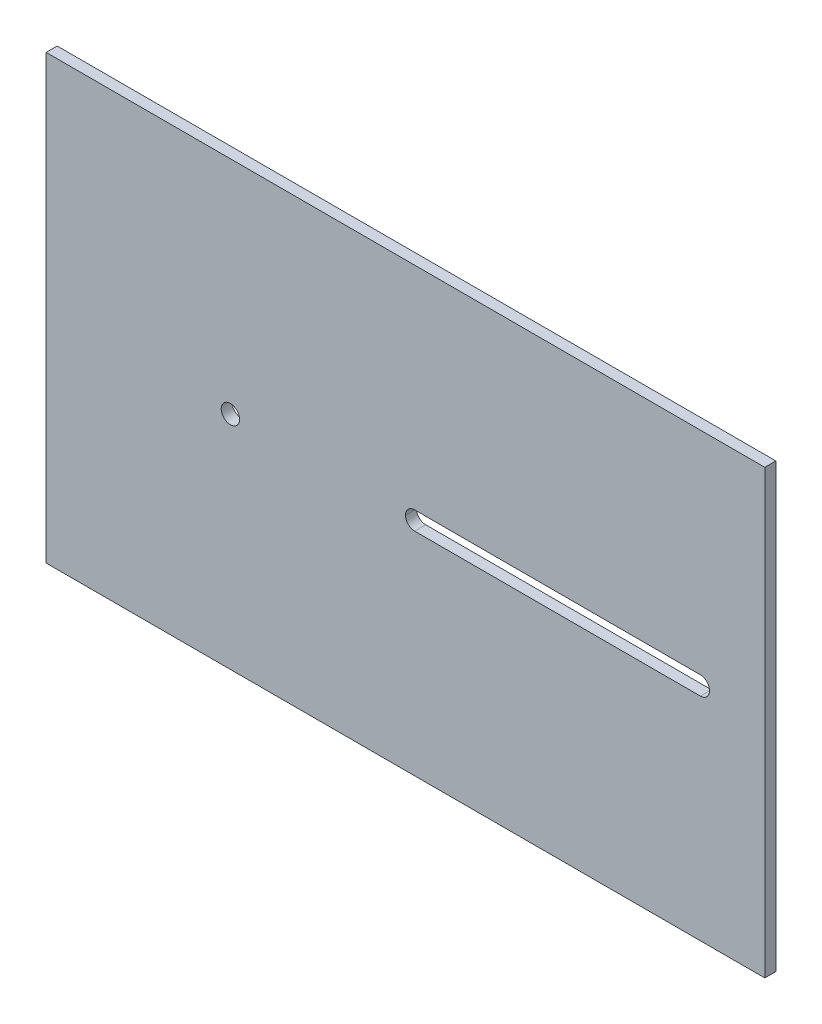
ISO-10303-21;
HEADER;
FILE_DESCRIPTION(('STEP AP214'),'2;1');
FILE_NAME('part.step','',(''),(''),'','','');
FILE_SCHEMA(('AUTOMOTIVE_DESIGN { 1 0 10303 214 1 1 1 1 }'));
ENDSEC;
DATA;
#1=APPLICATION_CONTEXT('core data for automotive mechanical design processes');
#2=APPLICATION_PROTOCOL_DEFINITION('international standard','automotive_design',2000,#1);
#3=PRODUCT_CONTEXT('',#1,'mechanical');
#4=PRODUCT('Part','Part','',(#3));
#5=PRODUCT_RELATED_PRODUCT_CATEGORY('part','',(#4));
#6=PRODUCT_DEFINITION_FORMATION('','',#4);
#7=PRODUCT_DEFINITION_CONTEXT('part definition',#1,'design');
#8=PRODUCT_DEFINITION('design','',#6,#7);
#9=PRODUCT_DEFINITION_SHAPE('','',#8);
#10=(LENGTH_UNIT() NAMED_UNIT(*) SI_UNIT(.MILLI.,.METRE.));
#11=(NAMED_UNIT(*) PLANE_ANGLE_UNIT() SI_UNIT($,.RADIAN.));
#12=(NAMED_UNIT(*) SI_UNIT($,.STERADIAN.) SOLID_ANGLE_UNIT());
#13=UNCERTAINTY_MEASURE_WITH_UNIT(LENGTH_MEASURE(1.E-05),#10,'distance_accuracy_value','');
#14=(GEOMETRIC_REPRESENTATION_CONTEXT(3) GLOBAL_UNCERTAINTY_ASSIGNED_CONTEXT((#13)) GLOBAL_UNIT_ASSIGNED_CONTEXT((#10,
#11,#12)) REPRESENTATION_CONTEXT('',''));
#15=CARTESIAN_POINT('',(0.,0.,0.));
#16=DIRECTION('',(0.,0.,1.));
#17=DIRECTION('',(1.,0.,0.));
#18=AXIS2_PLACEMENT_3D('',#15,#16,#17);
#19=CARTESIAN_POINT('',(-75.7745027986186,50.7636179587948,3.));
#20=DIRECTION('',(1.,0.,0.));
#21=DIRECTION('',(0.,1.,0.));
#22=AXIS2_PLACEMENT_3D('',#19,#20,#21);
#23=PLANE('',#22);
#24=DIRECTION('',(0.,-1.,0.));
#25=VECTOR('',#24,1.);
#26=CARTESIAN_POINT('',(-75.7745027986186,50.7636179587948,0.));
#27=LINE('',#26,#25);
#28=CARTESIAN_POINT('',(-75.7745027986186,50.7636179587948,0.));
#29=VERTEX_POINT('',#28);
#30=CARTESIAN_POINT('',(-75.7745027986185,-69.2363820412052,0.));
#31=VERTEX_POINT('',#30);
#32=EDGE_CURVE('E197',#29,#31,#27,.T.);
#33=ORIENTED_EDGE('',*,*,#32,.T.);
#34=DIRECTION('',(0.,0.,-1.));
#35=VECTOR('',#34,1.);
#36=CARTESIAN_POINT('',(-75.7745027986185,-69.2363820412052,3.));
#37=LINE('',#36,#35);
#38=CARTESIAN_POINT('',(-75.7745027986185,-69.2363820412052,3.));
#39=VERTEX_POINT('',#38);
#40=EDGE_CURVE('E11',#39,#31,#37,.T.);
#41=ORIENTED_EDGE('',*,*,#40,.F.);
#42=DIRECTION('',(0.,-1.,0.));
#43=VECTOR('',#42,1.);
#44=CARTESIAN_POINT('',(-75.7745027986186,50.7636179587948,3.));
#45=LINE('',#44,#43);
#46=CARTESIAN_POINT('',(-75.7745027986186,50.7636179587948,3.));
#47=VERTEX_POINT('',#46);
#48=EDGE_CURVE('E206',#47,#39,#45,.T.);
#49=ORIENTED_EDGE('',*,*,#48,.F.);
#50=DIRECTION('',(0.,0.,-1.));
#51=VECTOR('',#50,1.);
#52=CARTESIAN_POINT('',(-75.7745027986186,50.7636179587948,3.));
#53=LINE('',#52,#51);
#54=EDGE_CURVE('E216',#47,#29,#53,.T.);
#55=ORIENTED_EDGE('',*,*,#54,.T.);
#56=EDGE_LOOP('',(#33,#41,#49,#55));
#57=FACE_BOUND('',#56,.T.);
#58=ADVANCED_FACE('F34',(#57),#23,.F.);
#59=CARTESIAN_POINT('',(-75.7745027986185,-69.2363820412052,3.));
#60=DIRECTION('',(0.,1.,0.));
#61=DIRECTION('',(0.,0.,1.));
#62=AXIS2_PLACEMENT_3D('',#59,#60,#61);
#63=PLANE('',#62);
#64=DIRECTION('',(1.,0.,0.));
#65=VECTOR('',#64,1.);
#66=CARTESIAN_POINT('',(-75.7745027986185,-69.2363820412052,0.));
#67=LINE('',#66,#65);
#68=CARTESIAN_POINT('',(119.225497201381,-69.2363820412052,0.));
#69=VERTEX_POINT('',#68);
#70=EDGE_CURVE('E200',#31,#69,#67,.T.);
#71=ORIENTED_EDGE('',*,*,#70,.T.);
#72=DIRECTION('',(0.,0.,-1.));
#73=VECTOR('',#72,1.);
#74=CARTESIAN_POINT('',(119.225497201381,-69.2363820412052,3.));
#75=LINE('',#74,#73);
#76=CARTESIAN_POINT('',(119.225497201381,-69.2363820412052,3.));
#77=VERTEX_POINT('',#76);
#78=EDGE_CURVE('E41',#77,#69,#75,.T.);
#79=ORIENTED_EDGE('',*,*,#78,.F.);
#80=DIRECTION('',(1.,0.,0.));
#81=VECTOR('',#80,1.);
#82=CARTESIAN_POINT('',(-75.7745027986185,-69.2363820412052,3.));
#83=LINE('',#82,#81);
#84=EDGE_CURVE('E209',#39,#77,#83,.T.);
#85=ORIENTED_EDGE('',*,*,#84,.F.);
#86=ORIENTED_EDGE('',*,*,#40,.T.);
#87=EDGE_LOOP('',(#71,#79,#85,#86));
#88=FACE_BOUND('',#87,.T.);
#89=ADVANCED_FACE('F241',(#88),#63,.F.);
#90=CARTESIAN_POINT('',(119.225497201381,50.7636179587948,3.));
#91=DIRECTION('',(-1.,0.,0.));
#92=DIRECTION('',(0.,-1.,0.));
#93=AXIS2_PLACEMENT_3D('',#90,#91,#92);
#94=PLANE('',#93);
#95=DIRECTION('',(0.,1.,0.));
#96=VECTOR('',#95,1.);
#97=CARTESIAN_POINT('',(119.225497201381,50.7636179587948,0.));
#98=LINE('',#97,#96);
#99=CARTESIAN_POINT('',(119.225497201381,50.7636179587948,0.));
#100=VERTEX_POINT('',#99);
#101=EDGE_CURVE('E202',#69,#100,#98,.T.);
#102=ORIENTED_EDGE('',*,*,#101,.T.);
#103=DIRECTION('',(0.,0.,-1.));
#104=VECTOR('',#103,1.);
#105=CARTESIAN_POINT('',(119.225497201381,50.7636179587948,3.));
#106=LINE('',#105,#104);
#107=CARTESIAN_POINT('',(119.225497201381,50.7636179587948,3.));
#108=VERTEX_POINT('',#107);
#109=EDGE_CURVE('E219',#108,#100,#106,.T.);
#110=ORIENTED_EDGE('',*,*,#109,.F.);
#111=DIRECTION('',(0.,1.,0.));
#112=VECTOR('',#111,1.);
#113=CARTESIAN_POINT('',(119.225497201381,50.7636179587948,3.));
#114=LINE('',#113,#112);
#115=EDGE_CURVE('E211',#77,#108,#114,.T.);
#116=ORIENTED_EDGE('',*,*,#115,.F.);
#117=ORIENTED_EDGE('',*,*,#78,.T.);
#118=EDGE_LOOP('',(#102,#110,#116,#117));
#119=FACE_BOUND('',#118,.T.);
#120=ADVANCED_FACE('F226',(#119),#94,.F.);
#121=CARTESIAN_POINT('',(-75.7745027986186,50.7636179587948,3.));
#122=DIRECTION('',(0.,-1.,0.));
#123=DIRECTION('',(0.,0.,-1.));
#124=AXIS2_PLACEMENT_3D('',#121,#122,#123);
#125=PLANE('',#124);
#126=DIRECTION('',(-1.,0.,0.));
#127=VECTOR('',#126,1.);
#128=CARTESIAN_POINT('',(-75.7745027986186,50.7636179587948,0.));
#129=LINE('',#128,#127);
#130=EDGE_CURVE('E204',#100,#29,#129,.T.);
#131=ORIENTED_EDGE('',*,*,#130,.T.);
#132=ORIENTED_EDGE('',*,*,#54,.F.);
#133=DIRECTION('',(-1.,0.,0.));
#134=VECTOR('',#133,1.);
#135=CARTESIAN_POINT('',(-75.7745027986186,50.7636179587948,3.));
#136=LINE('',#135,#134);
#137=EDGE_CURVE('E213',#108,#47,#136,.T.);
#138=ORIENTED_EDGE('',*,*,#137,.F.);
#139=ORIENTED_EDGE('',*,*,#109,.T.);
#140=EDGE_LOOP('',(#131,#132,#138,#139));
#141=FACE_BOUND('',#140,.T.);
#142=ADVANCED_FACE('F235',(#141),#125,.F.);
#143=CARTESIAN_POINT('',(-75.7745027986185,-69.2363820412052,3.));
#144=DIRECTION('',(0.,0.,1.));
#145=DIRECTION('',(1.,0.,0.));
#146=AXIS2_PLACEMENT_3D('',#143,#144,#145);
#147=PLANE('',#146);
#148=CARTESIAN_POINT('',(24.2154972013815,-9.2263820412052,3.));
#149=DIRECTION('',(0.,0.,1.));
#150=DIRECTION('',(1.,0.,0.));
#151=AXIS2_PLACEMENT_3D('',#148,#149,#150);
#152=CIRCLE('',#151,2.49);
#153=CARTESIAN_POINT('',(24.2154972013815,-6.7363820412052,3.));
#154=VERTEX_POINT('',#153);
#155=CARTESIAN_POINT('',(21.7254972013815,-9.2263820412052,3.));
#156=VERTEX_POINT('',#155);
#157=EDGE_CURVE('E48',#154,#156,#152,.T.);
#158=ORIENTED_EDGE('',*,*,#157,.F.);
#159=DIRECTION('',(-1.,0.,0.));
#160=VECTOR('',#159,1.);
#161=CARTESIAN_POINT('',(24.2154972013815,-6.7363820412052,3.));
#162=LINE('',#161,#160);
#163=CARTESIAN_POINT('',(101.735497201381,-6.7363820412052,3.));
#164=VERTEX_POINT('',#163);
#165=EDGE_CURVE('E155',#164,#154,#162,.T.);
#166=ORIENTED_EDGE('',*,*,#165,.F.);
#167=CARTESIAN_POINT('',(101.735497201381,-9.2263820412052,3.));
#168=DIRECTION('',(0.,0.,1.));
#169=DIRECTION('',(-1.,0.,0.));
#170=AXIS2_PLACEMENT_3D('',#167,#168,#169);
#171=CIRCLE('',#170,2.49);
#172=CARTESIAN_POINT('',(104.225497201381,-9.22638204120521,3.));
#173=VERTEX_POINT('',#172);
#174=EDGE_CURVE('E152',#173,#164,#171,.T.);
#175=ORIENTED_EDGE('',*,*,#174,.F.);
#176=DIRECTION('',(0.,1.,0.));
#177=VECTOR('',#176,1.);
#178=CARTESIAN_POINT('',(104.225497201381,-9.22638204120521,3.));
#179=LINE('',#178,#177);
#180=CARTESIAN_POINT('',(104.225497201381,-9.24638204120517,3.));
#181=VERTEX_POINT('',#180);
#182=EDGE_CURVE('E149',#181,#173,#179,.T.);
#183=ORIENTED_EDGE('',*,*,#182,.F.);
#184=CARTESIAN_POINT('',(101.735497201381,-9.2463820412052,3.));
#185=DIRECTION('',(0.,0.,1.));
#186=DIRECTION('',(1.,0.,0.));
#187=AXIS2_PLACEMENT_3D('',#184,#185,#186);
#188=CIRCLE('',#187,2.49);
#189=CARTESIAN_POINT('',(101.735497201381,-11.7363820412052,3.));
#190=VERTEX_POINT('',#189);
#191=EDGE_CURVE('E143',#190,#181,#188,.T.);
#192=ORIENTED_EDGE('',*,*,#191,.F.);
#193=DIRECTION('',(1.,0.,0.));
#194=VECTOR('',#193,1.);
#195=CARTESIAN_POINT('',(24.2154972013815,-11.7363820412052,3.));
#196=LINE('',#195,#194);
#197=CARTESIAN_POINT('',(24.2154972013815,-11.7363820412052,3.));
#198=VERTEX_POINT('',#197);
#199=EDGE_CURVE('E141',#198,#190,#196,.T.);
#200=ORIENTED_EDGE('',*,*,#199,.F.);
#201=CARTESIAN_POINT('',(24.2154972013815,-9.2463820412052,3.));
#202=DIRECTION('',(0.,0.,1.));
#203=DIRECTION('',(-1.,0.,0.));
#204=AXIS2_PLACEMENT_3D('',#201,#202,#203);
#205=CIRCLE('',#204,2.49);
#206=CARTESIAN_POINT('',(21.7254972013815,-9.2463820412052,3.));
#207=VERTEX_POINT('',#206);
#208=EDGE_CURVE('E124',#207,#198,#205,.T.);
#209=ORIENTED_EDGE('',*,*,#208,.F.);
#210=DIRECTION('',(0.,-1.,0.));
#211=VECTOR('',#210,1.);
#212=CARTESIAN_POINT('',(21.7254972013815,-9.2263820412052,3.));
#213=LINE('',#212,#211);
#214=EDGE_CURVE('E133',#156,#207,#213,.T.);
#215=ORIENTED_EDGE('',*,*,#214,.F.);
#216=EDGE_LOOP('',(#158,#166,#175,#183,#192,#200,#209,#215));
#217=FACE_BOUND('',#216,.T.);
#218=CARTESIAN_POINT('',(-25.7745027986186,-9.23638204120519,3.));
#219=DIRECTION('',(0.,0.,1.));
#220=DIRECTION('',(1.,0.,0.));
#221=AXIS2_PLACEMENT_3D('',#218,#219,#220);
#222=CIRCLE('',#221,2.5);
#223=CARTESIAN_POINT('',(-23.2745027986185,-9.23638204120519,3.));
#224=VERTEX_POINT('',#223);
#225=EDGE_CURVE('E181',#224,#224,#222,.T.);
#226=ORIENTED_EDGE('',*,*,#225,.F.);
#227=EDGE_LOOP('',(#226));
#228=FACE_BOUND('',#227,.T.);
#229=ORIENTED_EDGE('',*,*,#48,.T.);
#230=ORIENTED_EDGE('',*,*,#84,.T.);
#231=ORIENTED_EDGE('',*,*,#115,.T.);
#232=ORIENTED_EDGE('',*,*,#137,.T.);
#233=EDGE_LOOP('',(#229,#230,#231,#232));
#234=FACE_BOUND('',#233,.T.);
#235=ADVANCED_FACE('F137',(#217,#228,#234),#147,.T.);
#236=CARTESIAN_POINT('',(-75.7745027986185,-69.2363820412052,0.));
#237=DIRECTION('',(0.,0.,1.));
#238=DIRECTION('',(1.,0.,0.));
#239=AXIS2_PLACEMENT_3D('',#236,#237,#238);
#240=PLANE('',#239);
#241=DIRECTION('',(-1.,0.,0.));
#242=VECTOR('',#241,1.);
#243=CARTESIAN_POINT('',(24.2154972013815,-6.7363820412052,0.));
#244=LINE('',#243,#242);
#245=CARTESIAN_POINT('',(101.735497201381,-6.7363820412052,0.));
#246=VERTEX_POINT('',#245);
#247=CARTESIAN_POINT('',(24.2154972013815,-6.7363820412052,0.));
#248=VERTEX_POINT('',#247);
#249=EDGE_CURVE('E176',#246,#248,#244,.T.);
#250=ORIENTED_EDGE('',*,*,#249,.T.);
#251=CARTESIAN_POINT('',(24.2154972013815,-9.2263820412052,0.));
#252=DIRECTION('',(0.,0.,1.));
#253=DIRECTION('',(1.,0.,0.));
#254=AXIS2_PLACEMENT_3D('',#251,#252,#253);
#255=CIRCLE('',#254,2.49);
#256=CARTESIAN_POINT('',(21.7254972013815,-9.2263820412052,0.));
#257=VERTEX_POINT('',#256);
#258=EDGE_CURVE('E158',#248,#257,#255,.T.);
#259=ORIENTED_EDGE('',*,*,#258,.T.);
#260=DIRECTION('',(0.,-1.,0.));
#261=VECTOR('',#260,1.);
#262=CARTESIAN_POINT('',(21.7254972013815,-9.2263820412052,0.));
#263=LINE('',#262,#261);
#264=CARTESIAN_POINT('',(21.7254972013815,-9.2463820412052,0.));
#265=VERTEX_POINT('',#264);
#266=EDGE_CURVE('E161',#257,#265,#263,.T.);
#267=ORIENTED_EDGE('',*,*,#266,.T.);
#268=CARTESIAN_POINT('',(24.2154972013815,-9.2463820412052,0.));
#269=DIRECTION('',(0.,0.,1.));
#270=DIRECTION('',(-1.,0.,0.));
#271=AXIS2_PLACEMENT_3D('',#268,#269,#270);
#272=CIRCLE('',#271,2.49);
#273=CARTESIAN_POINT('',(24.2154972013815,-11.7363820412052,0.));
#274=VERTEX_POINT('',#273);
#275=EDGE_CURVE('E56',#265,#274,#272,.T.);
#276=ORIENTED_EDGE('',*,*,#275,.T.);
#277=DIRECTION('',(1.,0.,0.));
#278=VECTOR('',#277,1.);
#279=CARTESIAN_POINT('',(24.2154972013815,-11.7363820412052,0.));
#280=LINE('',#279,#278);
#281=CARTESIAN_POINT('',(101.735497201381,-11.7363820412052,0.));
#282=VERTEX_POINT('',#281);
#283=EDGE_CURVE('E164',#274,#282,#280,.T.);
#284=ORIENTED_EDGE('',*,*,#283,.T.);
#285=CARTESIAN_POINT('',(101.735497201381,-9.2463820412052,0.));
#286=DIRECTION('',(0.,0.,1.));
#287=DIRECTION('',(1.,0.,0.));
#288=AXIS2_PLACEMENT_3D('',#285,#286,#287);
#289=CIRCLE('',#288,2.49);
#290=CARTESIAN_POINT('',(104.225497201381,-9.24638204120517,0.));
#291=VERTEX_POINT('',#290);
#292=EDGE_CURVE('E167',#282,#291,#289,.T.);
#293=ORIENTED_EDGE('',*,*,#292,.T.);
#294=DIRECTION('',(0.,1.,0.));
#295=VECTOR('',#294,1.);
#296=CARTESIAN_POINT('',(104.225497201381,-9.22638204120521,0.));
#297=LINE('',#296,#295);
#298=CARTESIAN_POINT('',(104.225497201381,-9.22638204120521,0.));
#299=VERTEX_POINT('',#298);
#300=EDGE_CURVE('E170',#291,#299,#297,.T.);
#301=ORIENTED_EDGE('',*,*,#300,.T.);
#302=CARTESIAN_POINT('',(101.735497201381,-9.2263820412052,0.));
#303=DIRECTION('',(0.,0.,1.));
#304=DIRECTION('',(-1.,0.,0.));
#305=AXIS2_PLACEMENT_3D('',#302,#303,#304);
#306=CIRCLE('',#305,2.49);
#307=EDGE_CURVE('E173',#299,#246,#306,.T.);
#308=ORIENTED_EDGE('',*,*,#307,.T.);
#309=EDGE_LOOP('',(#250,#259,#267,#276,#284,#293,#301,#308));
#310=FACE_BOUND('',#309,.T.);
#311=CARTESIAN_POINT('',(-25.7745027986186,-9.23638204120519,0.));
#312=DIRECTION('',(0.,0.,1.));
#313=DIRECTION('',(1.,0.,0.));
#314=AXIS2_PLACEMENT_3D('',#311,#312,#313);
#315=CIRCLE('',#314,2.5);
#316=CARTESIAN_POINT('',(-23.2745027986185,-9.23638204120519,0.));
#317=VERTEX_POINT('',#316);
#318=EDGE_CURVE('E194',#317,#317,#315,.T.);
#319=ORIENTED_EDGE('',*,*,#318,.T.);
#320=EDGE_LOOP('',(#319));
#321=FACE_BOUND('',#320,.T.);
#322=ORIENTED_EDGE('',*,*,#32,.F.);
#323=ORIENTED_EDGE('',*,*,#130,.F.);
#324=ORIENTED_EDGE('',*,*,#101,.F.);
#325=ORIENTED_EDGE('',*,*,#70,.F.);
#326=EDGE_LOOP('',(#322,#323,#324,#325));
#327=FACE_BOUND('',#326,.T.);
#328=ADVANCED_FACE('F232',(#310,#321,#327),#240,.F.);
#329=CARTESIAN_POINT('',(-25.7745027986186,-9.23638204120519,0.));
#330=DIRECTION('',(0.,0.,1.));
#331=DIRECTION('',(1.,0.,0.));
#332=AXIS2_PLACEMENT_3D('',#329,#330,#331);
#333=CYLINDRICAL_SURFACE('',#332,2.5);
#334=ORIENTED_EDGE('',*,*,#318,.F.);
#335=EDGE_LOOP('',(#334));
#336=FACE_BOUND('',#335,.T.);
#337=ORIENTED_EDGE('',*,*,#225,.T.);
#338=EDGE_LOOP('',(#337));
#339=FACE_BOUND('',#338,.T.);
#340=ADVANCED_FACE('F255',(#336,#339),#333,.F.);
#341=CARTESIAN_POINT('',(24.2154972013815,-9.2263820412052,0.));
#342=DIRECTION('',(0.,0.,1.));
#343=DIRECTION('',(1.,0.,0.));
#344=AXIS2_PLACEMENT_3D('',#341,#342,#343);
#345=CYLINDRICAL_SURFACE('',#344,2.49);
#346=ORIENTED_EDGE('',*,*,#157,.T.);
#347=DIRECTION('',(0.,0.,1.));
#348=VECTOR('',#347,1.);
#349=CARTESIAN_POINT('',(21.7254972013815,-9.2263820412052,0.));
#350=LINE('',#349,#348);
#351=EDGE_CURVE('E130',#257,#156,#350,.T.);
#352=ORIENTED_EDGE('',*,*,#351,.F.);
#353=ORIENTED_EDGE('',*,*,#258,.F.);
#354=DIRECTION('',(0.,0.,1.));
#355=VECTOR('',#354,1.);
#356=CARTESIAN_POINT('',(24.2154972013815,-6.7363820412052,0.));
#357=LINE('',#356,#355);
#358=EDGE_CURVE('E179',#248,#154,#357,.T.);
#359=ORIENTED_EDGE('',*,*,#358,.T.);
#360=EDGE_LOOP('',(#346,#352,#353,#359));
#361=FACE_BOUND('',#360,.T.);
#362=ADVANCED_FACE('F259',(#361),#345,.F.);
#363=CARTESIAN_POINT('',(24.2154972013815,-6.7363820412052,0.));
#364=DIRECTION('',(0.,1.,0.));
#365=DIRECTION('',(0.,0.,1.));
#366=AXIS2_PLACEMENT_3D('',#363,#364,#365);
#367=PLANE('',#366);
#368=ORIENTED_EDGE('',*,*,#165,.T.);
#369=ORIENTED_EDGE('',*,*,#358,.F.);
#370=ORIENTED_EDGE('',*,*,#249,.F.);
#371=DIRECTION('',(0.,0.,1.));
#372=VECTOR('',#371,1.);
#373=CARTESIAN_POINT('',(101.735497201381,-6.7363820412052,0.));
#374=LINE('',#373,#372);
#375=EDGE_CURVE('E182',#246,#164,#374,.T.);
#376=ORIENTED_EDGE('',*,*,#375,.T.);
#377=EDGE_LOOP('',(#368,#369,#370,#376));
#378=FACE_BOUND('',#377,.T.);
#379=ADVANCED_FACE('F263',(#378),#367,.F.);
#380=CARTESIAN_POINT('',(101.735497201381,-9.2263820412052,0.));
#381=DIRECTION('',(0.,0.,1.));
#382=DIRECTION('',(1.,0.,0.));
#383=AXIS2_PLACEMENT_3D('',#380,#381,#382);
#384=CYLINDRICAL_SURFACE('',#383,2.49);
#385=ORIENTED_EDGE('',*,*,#174,.T.);
#386=ORIENTED_EDGE('',*,*,#375,.F.);
#387=ORIENTED_EDGE('',*,*,#307,.F.);
#388=DIRECTION('',(0.,0.,1.));
#389=VECTOR('',#388,1.);
#390=CARTESIAN_POINT('',(104.225497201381,-9.22638204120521,0.));
#391=LINE('',#390,#389);
#392=EDGE_CURVE('E184',#299,#173,#391,.T.);
#393=ORIENTED_EDGE('',*,*,#392,.T.);
#394=EDGE_LOOP('',(#385,#386,#387,#393));
#395=FACE_BOUND('',#394,.T.);
#396=ADVANCED_FACE('F279',(#395),#384,.F.);
#397=CARTESIAN_POINT('',(104.225497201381,-9.22638204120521,0.));
#398=DIRECTION('',(1.,0.,0.));
#399=DIRECTION('',(0.,0.,-1.));
#400=AXIS2_PLACEMENT_3D('',#397,#398,#399);
#401=PLANE('',#400);
#402=ORIENTED_EDGE('',*,*,#182,.T.);
#403=ORIENTED_EDGE('',*,*,#392,.F.);
#404=ORIENTED_EDGE('',*,*,#300,.F.);
#405=DIRECTION('',(0.,0.,1.));
#406=VECTOR('',#405,1.);
#407=CARTESIAN_POINT('',(104.225497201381,-9.24638204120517,0.));
#408=LINE('',#407,#406);
#409=EDGE_CURVE('E186',#291,#181,#408,.T.);
#410=ORIENTED_EDGE('',*,*,#409,.T.);
#411=EDGE_LOOP('',(#402,#403,#404,#410));
#412=FACE_BOUND('',#411,.T.);
#413=ADVANCED_FACE('F275',(#412),#401,.F.);
#414=CARTESIAN_POINT('',(101.735497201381,-9.2463820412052,0.));
#415=DIRECTION('',(0.,0.,1.));
#416=DIRECTION('',(1.,0.,0.));
#417=AXIS2_PLACEMENT_3D('',#414,#415,#416);
#418=CYLINDRICAL_SURFACE('',#417,2.49);
#419=ORIENTED_EDGE('',*,*,#191,.T.);
#420=ORIENTED_EDGE('',*,*,#409,.F.);
#421=ORIENTED_EDGE('',*,*,#292,.F.);
#422=DIRECTION('',(0.,0.,1.));
#423=VECTOR('',#422,1.);
#424=CARTESIAN_POINT('',(101.735497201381,-11.7363820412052,0.));
#425=LINE('',#424,#423);
#426=EDGE_CURVE('E188',#282,#190,#425,.T.);
#427=ORIENTED_EDGE('',*,*,#426,.T.);
#428=EDGE_LOOP('',(#419,#420,#421,#427));
#429=FACE_BOUND('',#428,.T.);
#430=ADVANCED_FACE('F271',(#429),#418,.F.);
#431=CARTESIAN_POINT('',(24.2154972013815,-11.7363820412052,0.));
#432=DIRECTION('',(0.,-1.,0.));
#433=DIRECTION('',(0.,0.,-1.));
#434=AXIS2_PLACEMENT_3D('',#431,#432,#433);
#435=PLANE('',#434);
#436=ORIENTED_EDGE('',*,*,#199,.T.);
#437=ORIENTED_EDGE('',*,*,#426,.F.);
#438=ORIENTED_EDGE('',*,*,#283,.F.);
#439=DIRECTION('',(0.,0.,1.));
#440=VECTOR('',#439,1.);
#441=CARTESIAN_POINT('',(24.2154972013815,-11.7363820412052,0.));
#442=LINE('',#441,#440);
#443=EDGE_CURVE('E129',#274,#198,#442,.T.);
#444=ORIENTED_EDGE('',*,*,#443,.T.);
#445=EDGE_LOOP('',(#436,#437,#438,#444));
#446=FACE_BOUND('',#445,.T.);
#447=ADVANCED_FACE('F268',(#446),#435,.F.);
#448=CARTESIAN_POINT('',(24.2154972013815,-9.2463820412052,0.));
#449=DIRECTION('',(0.,0.,1.));
#450=DIRECTION('',(1.,0.,0.));
#451=AXIS2_PLACEMENT_3D('',#448,#449,#450);
#452=CYLINDRICAL_SURFACE('',#451,2.49);
#453=ORIENTED_EDGE('',*,*,#208,.T.);
#454=ORIENTED_EDGE('',*,*,#443,.F.);
#455=ORIENTED_EDGE('',*,*,#275,.F.);
#456=DIRECTION('',(0.,0.,1.));
#457=VECTOR('',#456,1.);
#458=CARTESIAN_POINT('',(21.7254972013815,-9.2463820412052,0.));
#459=LINE('',#458,#457);
#460=EDGE_CURVE('E120',#265,#207,#459,.T.);
#461=ORIENTED_EDGE('',*,*,#460,.T.);
#462=EDGE_LOOP('',(#453,#454,#455,#461));
#463=FACE_BOUND('',#462,.T.);
#464=ADVANCED_FACE('F122',(#463),#452,.F.);
#465=CARTESIAN_POINT('',(21.7254972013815,-9.2263820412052,0.));
#466=DIRECTION('',(-1.,0.,0.));
#467=DIRECTION('',(0.,0.,1.));
#468=AXIS2_PLACEMENT_3D('',#465,#466,#467);
#469=PLANE('',#468);
#470=ORIENTED_EDGE('',*,*,#214,.T.);
#471=ORIENTED_EDGE('',*,*,#460,.F.);
#472=ORIENTED_EDGE('',*,*,#266,.F.);
#473=ORIENTED_EDGE('',*,*,#351,.T.);
#474=EDGE_LOOP('',(#470,#471,#472,#473));
#475=FACE_BOUND('',#474,.T.);
#476=ADVANCED_FACE('F134',(#475),#469,.F.);
#477=CLOSED_SHELL('',(#58,#89,#120,#142,#235,#328,#340,#362,#379,#396,#413,#430,#447,#464,#476));
#478=MANIFOLD_SOLID_BREP('B2',#477);
#479=ADVANCED_BREP_SHAPE_REPRESENTATION('',(#18,#478),#14);
#480=SHAPE_DEFINITION_REPRESENTATION(#9,#479);
ENDSEC;
END-ISO-10303-21;
